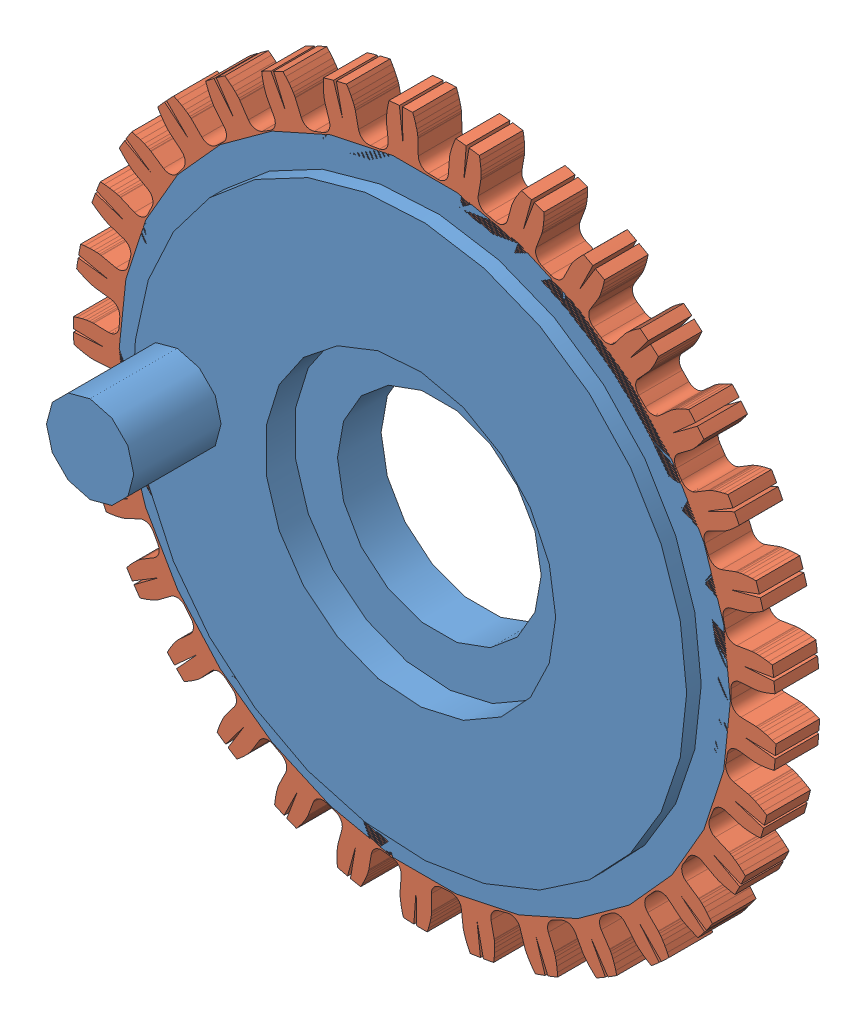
SolidWorks assembly Moulinet 2 eng.SLDASM, configuration Défaut (file format 11000). Lengths in mm.
Overall size (29.51 29.5 5.5).
2 component instances, 2 part files, 1 mates.
Components (placement in the parent):
- Moulinet 1-1: Moulinet 1.SLDPRT [Défaut] at (-110.6154 57.3068 -2.75) size (21 21 5.5)
- Engrenage 1-14-1: Engrenage 1-14.SLDPRT [Défaut] at (-110.6154 57.3068 0.25) x (0 0 -1) z (0.96675 0.255725 0) size (1.5 24.13 24.15)
Mates (geometry in assembly coordinates):
- Coïncidente1: coincident: plane of Moulinet 1-1 through (-110.6154 57.3068 -2.25) normal (0 0 -1); plane of Engrenage 1-14-1 through (-107.9964 46.7537 -2.25) normal (0 0 -1)
